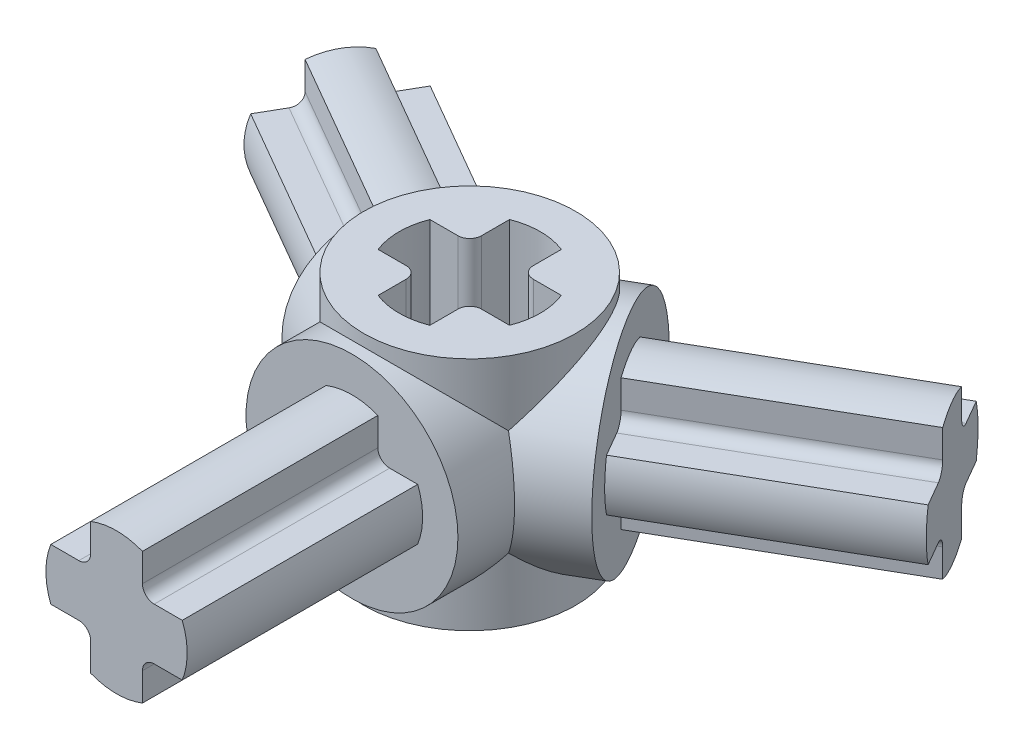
from build123d import *

# Parameters (mm, degrees)
BOSS_EXTRUDE1_DEPTH             = 4
BOSS_EXTRUDE1_DEPTH_BACK        = 4
SKETCH1_R                       = 3.6
BOSS_EXTRUDE2_REACH             = 11.312
BOSS_EXTRUDE2_END_RADIUS        = 3.6
SKETCH3_R                       = 3.6
BOSS_EXTRUDE3_REACH             = 14.787
BOSS_EXTRUDE3_DIRECTION_2_DEPTH = 4
CIRPATTERN1_COUNT               = 3


with BuildPart() as part:
    # Sketch1 → Boss-Extrude1 (new, two sides: drawn at the far end of the back side and taken through both)
    with BuildSketch(Plane(origin=(0, 0, 0), x_dir=(1, 0, 0), z_dir=(0, 1, 0)).offset(-BOSS_EXTRUDE1_DEPTH_BACK)):
        with Locations(Location((0, 0, 0), (0, 0, 270))):
            Circle(SKETCH1_R)
        with BuildLine():
            Line((-0.88, 2.232845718), (-0.88, 1.28))
            ThreePointArc((-0.88, 1.28), (-0.997157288, 0.997157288), (-1.28, 0.88))
            Line((-1.28, 0.88), (-2.232845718, 0.88))
            ThreePointArc((-2.232845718, 0.88), (-2.4, 0), (-2.232845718, -0.88))
            Line((-2.232845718, -0.88), (-1.28, -0.88))
            ThreePointArc((-1.28, -0.88), (-0.997157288, -0.997157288), (-0.88, -1.28))
            Line((-0.88, -1.28), (-0.88, -2.232845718))
            ThreePointArc((-0.88, -2.232845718), (0, -2.4), (0.88, -2.232845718))
            Line((0.88, -2.232845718), (0.88, -1.28))
            ThreePointArc((0.88, -1.28), (0.997157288, -0.997157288), (1.28, -0.88))
            Line((1.28, -0.88), (2.232845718, -0.88))
            ThreePointArc((2.232845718, -0.88), (2.4, 0), (2.232845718, 0.88))
            Line((2.232845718, 0.88), (1.28, 0.88))
            ThreePointArc((1.28, 0.88), (0.997157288, 0.997157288), (0.88, 1.28))
            Line((0.88, 1.28), (0.88, 2.232845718))
            ThreePointArc((0.88, 2.232845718), (0, 2.4), (-0.88, 2.232845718))
        make_face(mode=Mode.SUBTRACT)
    extrude(amount=BOSS_EXTRUDE1_DEPTH + BOSS_EXTRUDE1_DEPTH_BACK)

    # Boss-Extrude2: up to this cylinder (the profile starts outside it)
    boss_extrude2_end = Plane(origin=(0, 0, 0), z_dir=(0, 1, 0)) * Cylinder(BOSS_EXTRUDE2_END_RADIUS, 30.824, mode=Mode.PRIVATE)
    # Sketch3 → Boss-Extrude2 (add, up to the surface)
    with BuildSketch(Plane.XY.offset(4), mode=Mode.PRIVATE) as boss_extrude2_sk1:
        Circle(SKETCH3_R)
    boss_extrude2_tool1 = extrude(boss_extrude2_sk1.sketch, amount=-BOSS_EXTRUDE2_REACH, mode=Mode.PRIVATE) - boss_extrude2_end
    boss_extrude2 = boss_extrude2_tool1.solids().sort_by_distance((0, 0, 4))[0]
    add(boss_extrude2)

    # Sketch4 → Boss-Extrude3 (add, up to next)
    with BuildSketch(Plane.XY.offset(8), mode=Mode.PRIVATE) as boss_extrude3_sk1:
        with BuildLine():
            Line((-0.88, 2.232845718), (-0.88, 1.28))
            ThreePointArc((-0.88, 1.28), (-0.997157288, 0.997157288), (-1.28, 0.88))
            Line((-1.28, 0.88), (-2.232845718, 0.88))
            ThreePointArc((-2.232845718, 0.88), (-2.4, 0), (-2.232845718, -0.88))
            Line((-2.232845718, -0.88), (-1.28, -0.88))
            ThreePointArc((-1.28, -0.88), (-0.997157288, -0.997157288), (-0.88, -1.28))
            Line((-0.88, -1.28), (-0.88, -2.232845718))
            ThreePointArc((-0.88, -2.232845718), (0, -2.4), (0.88, -2.232845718))
            Line((0.88, -2.232845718), (0.88, -1.28))
            ThreePointArc((0.88, -1.28), (0.997157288, -0.997157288), (1.28, -0.88))
            Line((1.28, -0.88), (2.232845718, -0.88))
            ThreePointArc((2.232845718, -0.88), (2.4, 0), (2.232845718, 0.88))
            Line((2.232845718, 0.88), (1.28, 0.88))
            ThreePointArc((1.28, 0.88), (0.997157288, 0.997157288), (0.88, 1.28))
            Line((0.88, 1.28), (0.88, 2.232845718))
            ThreePointArc((0.88, 2.232845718), (0, 2.4), (-0.88, 2.232845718))
        make_face()
    boss_extrude3_tool1 = extrude(boss_extrude3_sk1.sketch, amount=-BOSS_EXTRUDE3_REACH, mode=Mode.PRIVATE) - part.part
    boss_extrude3 = boss_extrude3_tool1.solids().sort_by_distance((0, 0, 8))[0]
    add(boss_extrude3)

    # Sketch4 → Boss-Extrude3 direction 2 (add)
    with BuildSketch(Plane.XY.offset(8)):
        with BuildLine():
            Line((-0.88, 2.232845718), (-0.88, 1.28))
            ThreePointArc((-0.88, 1.28), (-0.997157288, 0.997157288), (-1.28, 0.88))
            Line((-1.28, 0.88), (-2.232845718, 0.88))
            ThreePointArc((-2.232845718, 0.88), (-2.4, 0), (-2.232845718, -0.88))
            Line((-2.232845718, -0.88), (-1.28, -0.88))
            ThreePointArc((-1.28, -0.88), (-0.997157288, -0.997157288), (-0.88, -1.28))
            Line((-0.88, -1.28), (-0.88, -2.232845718))
            ThreePointArc((-0.88, -2.232845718), (0, -2.4), (0.88, -2.232845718))
            Line((0.88, -2.232845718), (0.88, -1.28))
            ThreePointArc((0.88, -1.28), (0.997157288, -0.997157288), (1.28, -0.88))
            Line((1.28, -0.88), (2.232845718, -0.88))
            ThreePointArc((2.232845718, -0.88), (2.4, 0), (2.232845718, 0.88))
            Line((2.232845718, 0.88), (1.28, 0.88))
            ThreePointArc((1.28, 0.88), (0.997157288, 0.997157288), (0.88, 1.28))
            Line((0.88, 1.28), (0.88, 2.232845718))
            ThreePointArc((0.88, 2.232845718), (0, 2.4), (-0.88, 2.232845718))
        make_face()
    boss_extrude3_direction_2 = extrude(amount=BOSS_EXTRUDE3_DIRECTION_2_DEPTH)

    # CirPattern1: Boss-Extrude2, Boss-Extrude3, Boss-Extrude3 direction 2 ×3 about axis
    cirpattern1_axis = Axis((0, 0, 0), (0, 1, 0))
    add([boss_extrude2.rotate(cirpattern1_axis, i * 360 / CIRPATTERN1_COUNT) for i in range(1, CIRPATTERN1_COUNT)])
    add([boss_extrude3.rotate(cirpattern1_axis, i * 360 / CIRPATTERN1_COUNT) for i in range(1, CIRPATTERN1_COUNT)])
    add([boss_extrude3_direction_2.rotate(cirpattern1_axis, i * 360 / CIRPATTERN1_COUNT) for i in range(1, CIRPATTERN1_COUNT)])


solid = part.part
